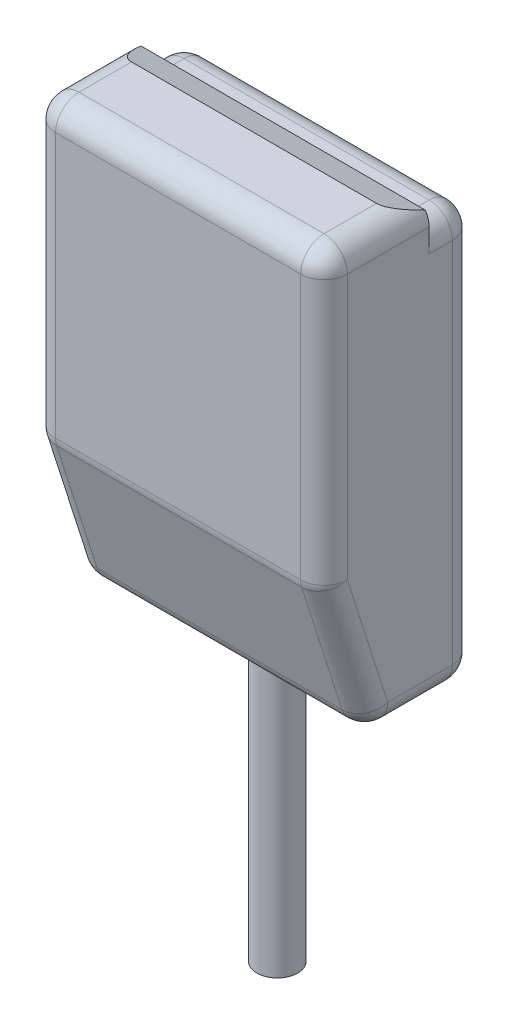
ISO-10303-21;
HEADER;
FILE_DESCRIPTION(('STEP AP214'),'2;1');
FILE_NAME('part.step','',(''),(''),'','','');
FILE_SCHEMA(('AUTOMOTIVE_DESIGN { 1 0 10303 214 1 1 1 1 }'));
ENDSEC;
DATA;
#1=APPLICATION_CONTEXT('core data for automotive mechanical design processes');
#2=APPLICATION_PROTOCOL_DEFINITION('international standard','automotive_design',2000,#1);
#3=PRODUCT_CONTEXT('',#1,'mechanical');
#4=PRODUCT('Part','Part','',(#3));
#5=PRODUCT_RELATED_PRODUCT_CATEGORY('part','',(#4));
#6=PRODUCT_DEFINITION_FORMATION('','',#4);
#7=PRODUCT_DEFINITION_CONTEXT('part definition',#1,'design');
#8=PRODUCT_DEFINITION('design','',#6,#7);
#9=PRODUCT_DEFINITION_SHAPE('','',#8);
#10=(LENGTH_UNIT() NAMED_UNIT(*) SI_UNIT(.MILLI.,.METRE.));
#11=(NAMED_UNIT(*) PLANE_ANGLE_UNIT() SI_UNIT($,.RADIAN.));
#12=(NAMED_UNIT(*) SI_UNIT($,.STERADIAN.) SOLID_ANGLE_UNIT());
#13=UNCERTAINTY_MEASURE_WITH_UNIT(LENGTH_MEASURE(1.E-05),#10,'distance_accuracy_value','');
#14=(GEOMETRIC_REPRESENTATION_CONTEXT(3) GLOBAL_UNCERTAINTY_ASSIGNED_CONTEXT((#13)) GLOBAL_UNIT_ASSIGNED_CONTEXT((#10,
#11,#12)) REPRESENTATION_CONTEXT('',''));
#15=CARTESIAN_POINT('',(0.,0.,0.));
#16=DIRECTION('',(0.,0.,1.));
#17=DIRECTION('',(1.,0.,0.));
#18=AXIS2_PLACEMENT_3D('',#15,#16,#17);
#19=CARTESIAN_POINT('',(50.,0.,4.00000000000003));
#20=DIRECTION('',(0.,1.,0.));
#21=DIRECTION('',(0.,0.,1.));
#22=AXIS2_PLACEMENT_3D('',#19,#20,#21);
#23=PLANE('',#22);
#24=DIRECTION('',(-1.,0.,0.));
#25=VECTOR('',#24,1.);
#26=CARTESIAN_POINT('',(50.,0.,15.0801904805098));
#27=LINE('',#26,#25);
#28=CARTESIAN_POINT('',(46.,0.,15.0801904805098));
#29=VERTEX_POINT('',#28);
#30=CARTESIAN_POINT('',(4.,0.,15.0801904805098));
#31=VERTEX_POINT('',#30);
#32=EDGE_CURVE('E366',#29,#31,#27,.T.);
#33=ORIENTED_EDGE('',*,*,#32,.T.);
#34=DIRECTION('',(0.,0.,-1.));
#35=VECTOR('',#34,1.);
#36=CARTESIAN_POINT('',(4.,0.,4.00000000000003));
#37=LINE('',#36,#35);
#38=CARTESIAN_POINT('',(4.,0.,4.00000000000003));
#39=VERTEX_POINT('',#38);
#40=EDGE_CURVE('E264',#31,#39,#37,.T.);
#41=ORIENTED_EDGE('',*,*,#40,.T.);
#42=DIRECTION('',(-1.,0.,0.));
#43=VECTOR('',#42,1.);
#44=CARTESIAN_POINT('',(50.,0.,4.00000000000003));
#45=LINE('',#44,#43);
#46=CARTESIAN_POINT('',(46.,0.,4.00000000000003));
#47=VERTEX_POINT('',#46);
#48=EDGE_CURVE('E363',#47,#39,#45,.T.);
#49=ORIENTED_EDGE('',*,*,#48,.F.);
#50=DIRECTION('',(0.,0.,-1.));
#51=VECTOR('',#50,1.);
#52=CARTESIAN_POINT('',(46.,0.,4.00000000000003));
#53=LINE('',#52,#51);
#54=EDGE_CURVE('E218',#47,#29,#53,.F.);
#55=ORIENTED_EDGE('',*,*,#54,.T.);
#56=EDGE_LOOP('',(#33,#41,#49,#55));
#57=FACE_BOUND('',#56,.T.);
#58=CARTESIAN_POINT('',(25.,0.,9.));
#59=DIRECTION('',(0.,1.,0.));
#60=DIRECTION('',(0.,0.,1.));
#61=AXIS2_PLACEMENT_3D('',#58,#59,#60);
#62=CIRCLE('',#61,3.5);
#63=CARTESIAN_POINT('',(25.,0.,12.5));
#64=VERTEX_POINT('',#63);
#65=EDGE_CURVE('E196',#64,#64,#62,.F.);
#66=ORIENTED_EDGE('',*,*,#65,.F.);
#67=EDGE_LOOP('',(#66));
#68=FACE_BOUND('',#67,.T.);
#69=ADVANCED_FACE('F31',(#57,#68),#23,.F.);
#70=CARTESIAN_POINT('',(50.,71.,8.));
#71=DIRECTION('',(0.,-1.,0.));
#72=DIRECTION('',(0.,0.,-1.));
#73=AXIS2_PLACEMENT_3D('',#70,#71,#72);
#74=PLANE('',#73);
#75=DIRECTION('',(-1.,0.,0.));
#76=VECTOR('',#75,1.);
#77=CARTESIAN_POINT('',(50.,71.,4.00000000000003));
#78=LINE('',#77,#76);
#79=CARTESIAN_POINT('',(46.,71.,4.00000000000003));
#80=VERTEX_POINT('',#79);
#81=CARTESIAN_POINT('',(4.,71.,4.00000000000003));
#82=VERTEX_POINT('',#81);
#83=EDGE_CURVE('E354',#80,#82,#78,.T.);
#84=ORIENTED_EDGE('',*,*,#83,.T.);
#85=DIRECTION('',(0.,0.,1.));
#86=VECTOR('',#85,1.);
#87=CARTESIAN_POINT('',(4.,71.,8.));
#88=LINE('',#87,#86);
#89=CARTESIAN_POINT('',(4.,71.,8.));
#90=VERTEX_POINT('',#89);
#91=EDGE_CURVE('E256',#82,#90,#88,.T.);
#92=ORIENTED_EDGE('',*,*,#91,.T.);
#93=DIRECTION('',(-1.,0.,0.));
#94=VECTOR('',#93,1.);
#95=CARTESIAN_POINT('',(50.,71.,8.));
#96=LINE('',#95,#94);
#97=CARTESIAN_POINT('',(46.,71.,8.));
#98=VERTEX_POINT('',#97);
#99=EDGE_CURVE('E201',#98,#90,#96,.T.);
#100=ORIENTED_EDGE('',*,*,#99,.F.);
#101=DIRECTION('',(0.,0.,1.));
#102=VECTOR('',#101,1.);
#103=CARTESIAN_POINT('',(46.,71.,8.));
#104=LINE('',#103,#102);
#105=EDGE_CURVE('E210',#98,#80,#104,.F.);
#106=ORIENTED_EDGE('',*,*,#105,.T.);
#107=EDGE_LOOP('',(#84,#92,#100,#106));
#108=FACE_BOUND('',#107,.T.);
#109=ADVANCED_FACE('F33',(#108),#74,.F.);
#110=CARTESIAN_POINT('',(50.,73.180148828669,8.));
#111=DIRECTION('',(0.,0.,1.));
#112=DIRECTION('',(1.,0.,0.));
#113=AXIS2_PLACEMENT_3D('',#110,#111,#112);
#114=PLANE('',#113);
#115=ORIENTED_EDGE('',*,*,#99,.T.);
#116=CARTESIAN_POINT('',(4.,67.,8.));
#117=DIRECTION('',(0.,0.,1.));
#118=DIRECTION('',(1.,0.,0.));
#119=AXIS2_PLACEMENT_3D('',#116,#117,#118);
#120=CIRCLE('',#119,4.);
#121=CARTESIAN_POINT('',(0.,67.,8.));
#122=VERTEX_POINT('',#121);
#123=EDGE_CURVE('E11',#90,#122,#120,.T.);
#124=ORIENTED_EDGE('',*,*,#123,.T.);
#125=DIRECTION('',(0.,1.,0.));
#126=VECTOR('',#125,1.);
#127=CARTESIAN_POINT('',(0.,73.180148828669,8.));
#128=LINE('',#127,#126);
#129=CARTESIAN_POINT('',(0.,71.,8.));
#130=VERTEX_POINT('',#129);
#131=EDGE_CURVE('E45',#130,#122,#128,.F.);
#132=ORIENTED_EDGE('',*,*,#131,.F.);
#133=CARTESIAN_POINT('',(4.,71.,8.));
#134=DIRECTION('',(0.,0.,1.));
#135=DIRECTION('',(1.,0.,0.));
#136=AXIS2_PLACEMENT_3D('',#133,#134,#135);
#137=CIRCLE('',#136,4.);
#138=CARTESIAN_POINT('',(0.646352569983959,73.180148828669,8.));
#139=VERTEX_POINT('',#138);
#140=EDGE_CURVE('E250',#130,#139,#137,.F.);
#141=ORIENTED_EDGE('',*,*,#140,.T.);
#142=DIRECTION('',(-1.,0.,0.));
#143=VECTOR('',#142,1.);
#144=CARTESIAN_POINT('',(50.,73.180148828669,8.));
#145=LINE('',#144,#143);
#146=CARTESIAN_POINT('',(49.353647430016,73.180148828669,8.));
#147=VERTEX_POINT('',#146);
#148=EDGE_CURVE('E175',#147,#139,#145,.T.);
#149=ORIENTED_EDGE('',*,*,#148,.F.);
#150=CARTESIAN_POINT('',(46.,71.,8.));
#151=DIRECTION('',(0.,0.,1.));
#152=DIRECTION('',(1.,0.,0.));
#153=AXIS2_PLACEMENT_3D('',#150,#151,#152);
#154=CIRCLE('',#153,4.);
#155=CARTESIAN_POINT('',(50.,71.,8.));
#156=VERTEX_POINT('',#155);
#157=EDGE_CURVE('E168',#147,#156,#154,.F.);
#158=ORIENTED_EDGE('',*,*,#157,.T.);
#159=DIRECTION('',(0.,1.,0.));
#160=VECTOR('',#159,1.);
#161=CARTESIAN_POINT('',(50.,73.180148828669,8.));
#162=LINE('',#161,#160);
#163=CARTESIAN_POINT('',(50.,67.,8.));
#164=VERTEX_POINT('',#163);
#165=EDGE_CURVE('E172',#164,#156,#162,.T.);
#166=ORIENTED_EDGE('',*,*,#165,.F.);
#167=CARTESIAN_POINT('',(46.,67.,8.));
#168=DIRECTION('',(0.,0.,1.));
#169=DIRECTION('',(1.,0.,0.));
#170=AXIS2_PLACEMENT_3D('',#167,#168,#169);
#171=CIRCLE('',#170,4.);
#172=EDGE_CURVE('E179',#164,#98,#171,.T.);
#173=ORIENTED_EDGE('',*,*,#172,.T.);
#174=EDGE_LOOP('',(#115,#124,#132,#141,#149,#158,#166,#173));
#175=FACE_BOUND('',#174,.T.);
#176=ADVANCED_FACE('F171',(#175),#114,.F.);
#177=CARTESIAN_POINT('',(50.,75.,13.));
#178=DIRECTION('',(0.,-0.939692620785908,0.342020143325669));
#179=DIRECTION('',(0.,-0.342020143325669,-0.939692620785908));
#180=AXIS2_PLACEMENT_3D('',#177,#178,#179);
#181=PLANE('',#180);
#182=ORIENTED_EDGE('',*,*,#148,.T.);
#183=CARTESIAN_POINT('',(4.,71.,2.01009032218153));
#184=DIRECTION('',(0.,-0.939692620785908,0.342020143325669));
#185=DIRECTION('',(0.,-0.342020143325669,-0.939692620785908));
#186=AXIS2_PLACEMENT_3D('',#183,#184,#185);
#187=ELLIPSE('',#186,11.6952176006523,4.);
#188=CARTESIAN_POINT('',(4.,75.,13.));
#189=VERTEX_POINT('',#188);
#190=EDGE_CURVE('E252',#139,#189,#187,.F.);
#191=ORIENTED_EDGE('',*,*,#190,.T.);
#192=DIRECTION('',(-1.,0.,0.));
#193=VECTOR('',#192,1.);
#194=CARTESIAN_POINT('',(50.,75.,13.));
#195=LINE('',#194,#193);
#196=CARTESIAN_POINT('',(46.,75.,13.));
#197=VERTEX_POINT('',#196);
#198=EDGE_CURVE('E376',#197,#189,#195,.T.);
#199=ORIENTED_EDGE('',*,*,#198,.F.);
#200=CARTESIAN_POINT('',(46.,71.,2.01009032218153));
#201=DIRECTION('',(0.,-0.939692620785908,0.342020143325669));
#202=DIRECTION('',(0.,0.342020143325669,0.939692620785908));
#203=AXIS2_PLACEMENT_3D('',#200,#201,#202);
#204=ELLIPSE('',#203,11.6952176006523,4.);
#205=EDGE_CURVE('E180',#197,#147,#204,.F.);
#206=ORIENTED_EDGE('',*,*,#205,.T.);
#207=EDGE_LOOP('',(#182,#191,#199,#206));
#208=FACE_BOUND('',#207,.T.);
#209=ADVANCED_FACE('F402',(#208),#181,.F.);
#210=CARTESIAN_POINT('',(50.,75.,22.));
#211=DIRECTION('',(0.,-1.,0.));
#212=DIRECTION('',(0.,0.,-1.));
#213=AXIS2_PLACEMENT_3D('',#210,#211,#212);
#214=PLANE('',#213);
#215=ORIENTED_EDGE('',*,*,#198,.T.);
#216=DIRECTION('',(0.,0.,1.));
#217=VECTOR('',#216,1.);
#218=CARTESIAN_POINT('',(4.,75.,22.));
#219=LINE('',#218,#217);
#220=CARTESIAN_POINT('',(4.,75.,22.));
#221=VERTEX_POINT('',#220);
#222=EDGE_CURVE('E234',#189,#221,#219,.T.);
#223=ORIENTED_EDGE('',*,*,#222,.T.);
#224=DIRECTION('',(-1.,0.,0.));
#225=VECTOR('',#224,1.);
#226=CARTESIAN_POINT('',(50.,75.,22.));
#227=LINE('',#226,#225);
#228=CARTESIAN_POINT('',(46.,75.,22.));
#229=VERTEX_POINT('',#228);
#230=EDGE_CURVE('E373',#229,#221,#227,.T.);
#231=ORIENTED_EDGE('',*,*,#230,.F.);
#232=DIRECTION('',(0.,0.,1.));
#233=VECTOR('',#232,1.);
#234=CARTESIAN_POINT('',(46.,75.,22.));
#235=LINE('',#234,#233);
#236=EDGE_CURVE('E230',#229,#197,#235,.F.);
#237=ORIENTED_EDGE('',*,*,#236,.T.);
#238=EDGE_LOOP('',(#215,#223,#231,#237));
#239=FACE_BOUND('',#238,.T.);
#240=ADVANCED_FACE('F502',(#239),#214,.F.);
#241=CARTESIAN_POINT('',(50.,71.,22.));
#242=DIRECTION('',(-1.,0.,0.));
#243=DIRECTION('',(0.,0.,1.));
#244=AXIS2_PLACEMENT_3D('',#241,#242,#243);
#245=CYLINDRICAL_SURFACE('',#244,4.);
#246=ORIENTED_EDGE('',*,*,#230,.T.);
#247=CARTESIAN_POINT('',(4.,71.,22.));
#248=DIRECTION('',(-1.,0.,0.));
#249=DIRECTION('',(0.,0.,1.));
#250=AXIS2_PLACEMENT_3D('',#247,#248,#249);
#251=CIRCLE('',#250,4.);
#252=CARTESIAN_POINT('',(4.,71.,26.));
#253=VERTEX_POINT('',#252);
#254=EDGE_CURVE('E254',#221,#253,#251,.F.);
#255=ORIENTED_EDGE('',*,*,#254,.T.);
#256=DIRECTION('',(-1.,0.,0.));
#257=VECTOR('',#256,1.);
#258=CARTESIAN_POINT('',(50.,71.,26.));
#259=LINE('',#258,#257);
#260=CARTESIAN_POINT('',(46.,71.,26.));
#261=VERTEX_POINT('',#260);
#262=EDGE_CURVE('E371',#261,#253,#259,.T.);
#263=ORIENTED_EDGE('',*,*,#262,.F.);
#264=CARTESIAN_POINT('',(46.,71.,22.));
#265=DIRECTION('',(-1.,0.,0.));
#266=DIRECTION('',(0.,0.,1.));
#267=AXIS2_PLACEMENT_3D('',#264,#265,#266);
#268=CIRCLE('',#267,4.);
#269=EDGE_CURVE('E228',#261,#229,#268,.T.);
#270=ORIENTED_EDGE('',*,*,#269,.T.);
#271=EDGE_LOOP('',(#246,#255,#263,#270));
#272=FACE_BOUND('',#271,.T.);
#273=ADVANCED_FACE('F499',(#272),#245,.T.);
#274=CARTESIAN_POINT('',(50.,25.6244047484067,26.));
#275=DIRECTION('',(0.,0.,-1.));
#276=DIRECTION('',(-1.,0.,0.));
#277=AXIS2_PLACEMENT_3D('',#274,#275,#276);
#278=PLANE('',#277);
#279=ORIENTED_EDGE('',*,*,#262,.T.);
#280=DIRECTION('',(0.,-1.,0.));
#281=VECTOR('',#280,1.);
#282=CARTESIAN_POINT('',(4.,25.6244047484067,26.));
#283=LINE('',#282,#281);
#284=CARTESIAN_POINT('',(4.,25.6244047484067,26.));
#285=VERTEX_POINT('',#284);
#286=EDGE_CURVE('E39',#253,#285,#283,.T.);
#287=ORIENTED_EDGE('',*,*,#286,.T.);
#288=DIRECTION('',(-1.,0.,0.));
#289=VECTOR('',#288,1.);
#290=CARTESIAN_POINT('',(50.,25.6244047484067,26.));
#291=LINE('',#290,#289);
#292=CARTESIAN_POINT('',(46.,25.6244047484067,26.));
#293=VERTEX_POINT('',#292);
#294=EDGE_CURVE('E278',#293,#285,#291,.T.);
#295=ORIENTED_EDGE('',*,*,#294,.F.);
#296=DIRECTION('',(0.,-1.,0.));
#297=VECTOR('',#296,1.);
#298=CARTESIAN_POINT('',(46.,25.6244047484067,26.));
#299=LINE('',#298,#297);
#300=EDGE_CURVE('E226',#293,#261,#299,.F.);
#301=ORIENTED_EDGE('',*,*,#300,.T.);
#302=EDGE_LOOP('',(#279,#287,#295,#301));
#303=FACE_BOUND('',#302,.T.);
#304=ADVANCED_FACE('F496',(#303),#278,.F.);
#305=CARTESIAN_POINT('',(50.,25.6244047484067,22.));
#306=DIRECTION('',(-1.,0.,0.));
#307=DIRECTION('',(0.,0.,1.));
#308=AXIS2_PLACEMENT_3D('',#305,#306,#307);
#309=CYLINDRICAL_SURFACE('',#308,4.);
#310=ORIENTED_EDGE('',*,*,#294,.T.);
#311=CARTESIAN_POINT('',(4.,25.6244047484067,22.));
#312=DIRECTION('',(-1.,0.,0.));
#313=DIRECTION('',(0.,0.,1.));
#314=AXIS2_PLACEMENT_3D('',#311,#312,#313);
#315=CIRCLE('',#314,4.);
#316=CARTESIAN_POINT('',(4.,24.4053018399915,25.8096965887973));
#317=VERTEX_POINT('',#316);
#318=EDGE_CURVE('E270',#285,#317,#315,.F.);
#319=ORIENTED_EDGE('',*,*,#318,.T.);
#320=DIRECTION('',(-1.,0.,0.));
#321=VECTOR('',#320,1.);
#322=CARTESIAN_POINT('',(50.,24.4053018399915,25.8096965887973));
#323=LINE('',#322,#321);
#324=CARTESIAN_POINT('',(46.,24.4053018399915,25.8096965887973));
#325=VERTEX_POINT('',#324);
#326=EDGE_CURVE('E276',#325,#317,#323,.T.);
#327=ORIENTED_EDGE('',*,*,#326,.F.);
#328=CARTESIAN_POINT('',(46.,25.6244047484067,22.));
#329=DIRECTION('',(-1.,0.,0.));
#330=DIRECTION('',(0.,0.,1.));
#331=AXIS2_PLACEMENT_3D('',#328,#329,#330);
#332=CIRCLE('',#331,4.);
#333=EDGE_CURVE('E224',#325,#293,#332,.T.);
#334=ORIENTED_EDGE('',*,*,#333,.T.);
#335=EDGE_LOOP('',(#310,#319,#327,#334));
#336=FACE_BOUND('',#335,.T.);
#337=ADVANCED_FACE('F275',(#336),#309,.T.);
#338=CARTESIAN_POINT('',(50.,2.78089709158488,18.8898870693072));
#339=DIRECTION('',(0.,0.304775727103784,-0.952424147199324));
#340=DIRECTION('',(0.,0.952424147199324,0.304775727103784));
#341=AXIS2_PLACEMENT_3D('',#338,#339,#340);
#342=PLANE('',#341);
#343=ORIENTED_EDGE('',*,*,#326,.T.);
#344=DIRECTION('',(0.,-0.952424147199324,-0.304775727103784));
#345=VECTOR('',#344,1.);
#346=CARTESIAN_POINT('',(4.,2.78089709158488,18.8898870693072));
#347=LINE('',#346,#345);
#348=CARTESIAN_POINT('',(4.,2.78089709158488,18.8898870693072));
#349=VERTEX_POINT('',#348);
#350=EDGE_CURVE('E268',#317,#349,#347,.T.);
#351=ORIENTED_EDGE('',*,*,#350,.T.);
#352=DIRECTION('',(-1.,0.,0.));
#353=VECTOR('',#352,1.);
#354=CARTESIAN_POINT('',(50.,2.78089709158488,18.8898870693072));
#355=LINE('',#354,#353);
#356=CARTESIAN_POINT('',(46.,2.78089709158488,18.8898870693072));
#357=VERTEX_POINT('',#356);
#358=EDGE_CURVE('E289',#357,#349,#355,.T.);
#359=ORIENTED_EDGE('',*,*,#358,.F.);
#360=DIRECTION('',(0.,-0.952424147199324,-0.304775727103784));
#361=VECTOR('',#360,1.);
#362=CARTESIAN_POINT('',(46.,2.78089709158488,18.8898870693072));
#363=LINE('',#362,#361);
#364=EDGE_CURVE('E222',#357,#325,#363,.F.);
#365=ORIENTED_EDGE('',*,*,#364,.T.);
#366=EDGE_LOOP('',(#343,#351,#359,#365));
#367=FACE_BOUND('',#366,.T.);
#368=ADVANCED_FACE('F285',(#367),#342,.F.);
#369=CARTESIAN_POINT('',(50.,4.,15.0801904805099));
#370=DIRECTION('',(-1.,0.,0.));
#371=DIRECTION('',(0.,0.,1.));
#372=AXIS2_PLACEMENT_3D('',#369,#370,#371);
#373=CYLINDRICAL_SURFACE('',#372,4.);
#374=ORIENTED_EDGE('',*,*,#358,.T.);
#375=CARTESIAN_POINT('',(4.,4.,15.0801904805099));
#376=DIRECTION('',(-1.,0.,0.));
#377=DIRECTION('',(0.,0.,1.));
#378=AXIS2_PLACEMENT_3D('',#375,#376,#377);
#379=CIRCLE('',#378,4.);
#380=EDGE_CURVE('E266',#349,#31,#379,.F.);
#381=ORIENTED_EDGE('',*,*,#380,.T.);
#382=ORIENTED_EDGE('',*,*,#32,.F.);
#383=CARTESIAN_POINT('',(46.,4.,15.0801904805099));
#384=DIRECTION('',(-1.,0.,0.));
#385=DIRECTION('',(0.,0.,1.));
#386=AXIS2_PLACEMENT_3D('',#383,#384,#385);
#387=CIRCLE('',#386,4.);
#388=EDGE_CURVE('E220',#29,#357,#387,.T.);
#389=ORIENTED_EDGE('',*,*,#388,.T.);
#390=EDGE_LOOP('',(#374,#381,#382,#389));
#391=FACE_BOUND('',#390,.T.);
#392=ADVANCED_FACE('F467',(#391),#373,.T.);
#393=CARTESIAN_POINT('',(50.,4.,4.));
#394=DIRECTION('',(-1.,0.,0.));
#395=DIRECTION('',(0.,0.,1.));
#396=AXIS2_PLACEMENT_3D('',#393,#394,#395);
#397=CYLINDRICAL_SURFACE('',#396,4.);
#398=ORIENTED_EDGE('',*,*,#48,.T.);
#399=CARTESIAN_POINT('',(4.,4.,4.));
#400=DIRECTION('',(-1.,0.,0.));
#401=DIRECTION('',(0.,0.,1.));
#402=AXIS2_PLACEMENT_3D('',#399,#400,#401);
#403=CIRCLE('',#402,4.);
#404=CARTESIAN_POINT('',(4.,4.00000000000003,0.));
#405=VERTEX_POINT('',#404);
#406=EDGE_CURVE('E262',#39,#405,#403,.F.);
#407=ORIENTED_EDGE('',*,*,#406,.T.);
#408=DIRECTION('',(-1.,0.,0.));
#409=VECTOR('',#408,1.);
#410=CARTESIAN_POINT('',(50.,4.00000000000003,0.));
#411=LINE('',#410,#409);
#412=CARTESIAN_POINT('',(46.,4.00000000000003,0.));
#413=VERTEX_POINT('',#412);
#414=EDGE_CURVE('E360',#413,#405,#411,.T.);
#415=ORIENTED_EDGE('',*,*,#414,.F.);
#416=CARTESIAN_POINT('',(46.,4.,4.));
#417=DIRECTION('',(-1.,0.,0.));
#418=DIRECTION('',(0.,0.,1.));
#419=AXIS2_PLACEMENT_3D('',#416,#417,#418);
#420=CIRCLE('',#419,4.);
#421=EDGE_CURVE('E216',#413,#47,#420,.T.);
#422=ORIENTED_EDGE('',*,*,#421,.T.);
#423=EDGE_LOOP('',(#398,#407,#415,#422));
#424=FACE_BOUND('',#423,.T.);
#425=ADVANCED_FACE('F472',(#424),#397,.T.);
#426=CARTESIAN_POINT('',(50.,4.00000000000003,0.));
#427=DIRECTION('',(0.,0.,1.));
#428=DIRECTION('',(1.,0.,0.));
#429=AXIS2_PLACEMENT_3D('',#426,#427,#428);
#430=PLANE('',#429);
#431=ORIENTED_EDGE('',*,*,#414,.T.);
#432=DIRECTION('',(0.,1.,0.));
#433=VECTOR('',#432,1.);
#434=CARTESIAN_POINT('',(4.,67.,0.));
#435=LINE('',#434,#433);
#436=CARTESIAN_POINT('',(4.,67.,0.));
#437=VERTEX_POINT('',#436);
#438=EDGE_CURVE('E260',#405,#437,#435,.T.);
#439=ORIENTED_EDGE('',*,*,#438,.T.);
#440=DIRECTION('',(-1.,0.,0.));
#441=VECTOR('',#440,1.);
#442=CARTESIAN_POINT('',(50.,67.,0.));
#443=LINE('',#442,#441);
#444=CARTESIAN_POINT('',(46.,67.,0.));
#445=VERTEX_POINT('',#444);
#446=EDGE_CURVE('E357',#445,#437,#443,.T.);
#447=ORIENTED_EDGE('',*,*,#446,.F.);
#448=DIRECTION('',(0.,1.,0.));
#449=VECTOR('',#448,1.);
#450=CARTESIAN_POINT('',(46.,4.00000000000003,0.));
#451=LINE('',#450,#449);
#452=EDGE_CURVE('E214',#445,#413,#451,.F.);
#453=ORIENTED_EDGE('',*,*,#452,.T.);
#454=EDGE_LOOP('',(#431,#439,#447,#453));
#455=FACE_BOUND('',#454,.T.);
#456=ADVANCED_FACE('F475',(#455),#430,.F.);
#457=CARTESIAN_POINT('',(50.,67.,4.));
#458=DIRECTION('',(-1.,0.,0.));
#459=DIRECTION('',(0.,0.,1.));
#460=AXIS2_PLACEMENT_3D('',#457,#458,#459);
#461=CYLINDRICAL_SURFACE('',#460,4.);
#462=ORIENTED_EDGE('',*,*,#446,.T.);
#463=CARTESIAN_POINT('',(4.,67.,4.));
#464=DIRECTION('',(-1.,0.,0.));
#465=DIRECTION('',(0.,0.,1.));
#466=AXIS2_PLACEMENT_3D('',#463,#464,#465);
#467=CIRCLE('',#466,4.);
#468=EDGE_CURVE('E258',#437,#82,#467,.F.);
#469=ORIENTED_EDGE('',*,*,#468,.T.);
#470=ORIENTED_EDGE('',*,*,#83,.F.);
#471=CARTESIAN_POINT('',(46.,67.,4.));
#472=DIRECTION('',(-1.,0.,0.));
#473=DIRECTION('',(0.,0.,1.));
#474=AXIS2_PLACEMENT_3D('',#471,#472,#473);
#475=CIRCLE('',#474,4.);
#476=EDGE_CURVE('E212',#80,#445,#475,.T.);
#477=ORIENTED_EDGE('',*,*,#476,.T.);
#478=EDGE_LOOP('',(#462,#469,#470,#477));
#479=FACE_BOUND('',#478,.T.);
#480=ADVANCED_FACE('F445',(#479),#461,.T.);
#481=CARTESIAN_POINT('',(50.,67.,4.));
#482=DIRECTION('',(-1.,0.,0.));
#483=DIRECTION('',(0.,0.,1.));
#484=AXIS2_PLACEMENT_3D('',#481,#482,#483);
#485=PLANE('',#484);
#486=DIRECTION('',(0.,1.,0.));
#487=VECTOR('',#486,1.);
#488=CARTESIAN_POINT('',(50.,67.,4.));
#489=LINE('',#488,#487);
#490=CARTESIAN_POINT('',(50.,4.,4.));
#491=VERTEX_POINT('',#490);
#492=CARTESIAN_POINT('',(50.,67.,4.));
#493=VERTEX_POINT('',#492);
#494=EDGE_CURVE('E188',#491,#493,#489,.T.);
#495=ORIENTED_EDGE('',*,*,#494,.T.);
#496=DIRECTION('',(0.,0.,1.));
#497=VECTOR('',#496,1.);
#498=CARTESIAN_POINT('',(50.,67.,4.));
#499=LINE('',#498,#497);
#500=EDGE_CURVE('E187',#493,#164,#499,.T.);
#501=ORIENTED_EDGE('',*,*,#500,.T.);
#502=ORIENTED_EDGE('',*,*,#165,.T.);
#503=DIRECTION('',(0.,0.,1.));
#504=VECTOR('',#503,1.);
#505=CARTESIAN_POINT('',(50.,71.,4.));
#506=LINE('',#505,#504);
#507=CARTESIAN_POINT('',(50.,71.,22.));
#508=VERTEX_POINT('',#507);
#509=EDGE_CURVE('E184',#156,#508,#506,.T.);
#510=ORIENTED_EDGE('',*,*,#509,.T.);
#511=DIRECTION('',(0.,-1.,0.));
#512=VECTOR('',#511,1.);
#513=CARTESIAN_POINT('',(50.,67.,22.));
#514=LINE('',#513,#512);
#515=CARTESIAN_POINT('',(50.,25.6244047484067,22.));
#516=VERTEX_POINT('',#515);
#517=EDGE_CURVE('E195',#508,#516,#514,.T.);
#518=ORIENTED_EDGE('',*,*,#517,.T.);
#519=DIRECTION('',(0.,-0.952424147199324,-0.304775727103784));
#520=VECTOR('',#519,1.);
#521=CARTESIAN_POINT('',(50.,57.931729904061,32.3383440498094));
#522=LINE('',#521,#520);
#523=CARTESIAN_POINT('',(50.,4.,15.0801904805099));
#524=VERTEX_POINT('',#523);
#525=EDGE_CURVE('E198',#516,#524,#522,.T.);
#526=ORIENTED_EDGE('',*,*,#525,.T.);
#527=DIRECTION('',(0.,0.,-1.));
#528=VECTOR('',#527,1.);
#529=CARTESIAN_POINT('',(50.,4.,3.99999999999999));
#530=LINE('',#529,#528);
#531=EDGE_CURVE('E206',#524,#491,#530,.T.);
#532=ORIENTED_EDGE('',*,*,#531,.T.);
#533=EDGE_LOOP('',(#495,#501,#502,#510,#518,#526,#532));
#534=FACE_BOUND('',#533,.T.);
#535=ADVANCED_FACE('F183',(#534),#485,.F.);
#536=CARTESIAN_POINT('',(0.,67.,4.));
#537=DIRECTION('',(-1.,0.,0.));
#538=DIRECTION('',(0.,0.,1.));
#539=AXIS2_PLACEMENT_3D('',#536,#537,#538);
#540=PLANE('',#539);
#541=DIRECTION('',(0.,-1.,0.));
#542=VECTOR('',#541,1.);
#543=CARTESIAN_POINT('',(0.,71.,22.));
#544=LINE('',#543,#542);
#545=CARTESIAN_POINT('',(0.,25.6244047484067,22.));
#546=VERTEX_POINT('',#545);
#547=CARTESIAN_POINT('',(0.,71.,22.));
#548=VERTEX_POINT('',#547);
#549=EDGE_CURVE('E237',#546,#548,#544,.F.);
#550=ORIENTED_EDGE('',*,*,#549,.T.);
#551=DIRECTION('',(0.,0.,1.));
#552=VECTOR('',#551,1.);
#553=CARTESIAN_POINT('',(0.,71.,13.));
#554=LINE('',#553,#552);
#555=EDGE_CURVE('E248',#548,#130,#554,.F.);
#556=ORIENTED_EDGE('',*,*,#555,.T.);
#557=ORIENTED_EDGE('',*,*,#131,.T.);
#558=DIRECTION('',(0.,0.,1.));
#559=VECTOR('',#558,1.);
#560=CARTESIAN_POINT('',(0.,67.,4.00000000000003));
#561=LINE('',#560,#559);
#562=CARTESIAN_POINT('',(0.,67.,4.));
#563=VERTEX_POINT('',#562);
#564=EDGE_CURVE('E245',#122,#563,#561,.F.);
#565=ORIENTED_EDGE('',*,*,#564,.T.);
#566=DIRECTION('',(0.,1.,0.));
#567=VECTOR('',#566,1.);
#568=CARTESIAN_POINT('',(0.,4.00000000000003,4.));
#569=LINE('',#568,#567);
#570=CARTESIAN_POINT('',(0.,4.,4.));
#571=VERTEX_POINT('',#570);
#572=EDGE_CURVE('E243',#563,#571,#569,.F.);
#573=ORIENTED_EDGE('',*,*,#572,.T.);
#574=DIRECTION('',(0.,0.,-1.));
#575=VECTOR('',#574,1.);
#576=CARTESIAN_POINT('',(0.,4.,15.0801904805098));
#577=LINE('',#576,#575);
#578=CARTESIAN_POINT('',(0.,4.,15.0801904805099));
#579=VERTEX_POINT('',#578);
#580=EDGE_CURVE('E241',#571,#579,#577,.F.);
#581=ORIENTED_EDGE('',*,*,#580,.T.);
#582=DIRECTION('',(0.,-0.952424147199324,-0.304775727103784));
#583=VECTOR('',#582,1.);
#584=CARTESIAN_POINT('',(0.,25.6244047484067,22.));
#585=LINE('',#584,#583);
#586=EDGE_CURVE('E239',#579,#546,#585,.F.);
#587=ORIENTED_EDGE('',*,*,#586,.T.);
#588=EDGE_LOOP('',(#550,#556,#557,#565,#573,#581,#587));
#589=FACE_BOUND('',#588,.T.);
#590=ADVANCED_FACE('F390',(#589),#540,.T.);
#591=CARTESIAN_POINT('',(25.,-50.,8.99999999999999));
#592=DIRECTION('',(0.,1.,0.));
#593=DIRECTION('',(0.,0.,1.));
#594=AXIS2_PLACEMENT_3D('',#591,#592,#593);
#595=CYLINDRICAL_SURFACE('',#594,3.5);
#596=CARTESIAN_POINT('',(25.,-50.,8.99999999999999));
#597=DIRECTION('',(0.,-1.,0.));
#598=DIRECTION('',(0.,0.,-1.));
#599=AXIS2_PLACEMENT_3D('',#596,#597,#598);
#600=CIRCLE('',#599,3.5);
#601=CARTESIAN_POINT('',(25.,-50.,5.49999999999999));
#602=VERTEX_POINT('',#601);
#603=EDGE_CURVE('E351',#602,#602,#600,.T.);
#604=ORIENTED_EDGE('',*,*,#603,.F.);
#605=EDGE_LOOP('',(#604));
#606=FACE_BOUND('',#605,.T.);
#607=ORIENTED_EDGE('',*,*,#65,.T.);
#608=EDGE_LOOP('',(#607));
#609=FACE_BOUND('',#608,.T.);
#610=ADVANCED_FACE('F565',(#606,#609),#595,.T.);
#611=CARTESIAN_POINT('',(25.,-50.,8.99999999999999));
#612=DIRECTION('',(0.,-1.,0.));
#613=DIRECTION('',(0.,0.,-1.));
#614=AXIS2_PLACEMENT_3D('',#611,#612,#613);
#615=PLANE('',#614);
#616=ORIENTED_EDGE('',*,*,#603,.T.);
#617=EDGE_LOOP('',(#616));
#618=FACE_BOUND('',#617,.T.);
#619=ADVANCED_FACE('F689',(#618),#615,.T.);
#620=CARTESIAN_POINT('',(46.,71.,4.));
#621=DIRECTION('',(0.,0.,1.));
#622=DIRECTION('',(1.,0.,0.));
#623=AXIS2_PLACEMENT_3D('',#620,#621,#622);
#624=CYLINDRICAL_SURFACE('',#623,4.);
#625=ORIENTED_EDGE('',*,*,#205,.F.);
#626=ORIENTED_EDGE('',*,*,#236,.F.);
#627=CARTESIAN_POINT('',(46.,71.,22.));
#628=DIRECTION('',(0.,0.,1.));
#629=DIRECTION('',(0.,-1.,0.));
#630=AXIS2_PLACEMENT_3D('',#627,#628,#629);
#631=CIRCLE('',#630,4.);
#632=EDGE_CURVE('E193',#508,#229,#631,.T.);
#633=ORIENTED_EDGE('',*,*,#632,.F.);
#634=ORIENTED_EDGE('',*,*,#509,.F.);
#635=ORIENTED_EDGE('',*,*,#157,.F.);
#636=EDGE_LOOP('',(#625,#626,#633,#634,#635));
#637=FACE_BOUND('',#636,.T.);
#638=ADVANCED_FACE('F190',(#637),#624,.T.);
#639=CARTESIAN_POINT('',(46.,71.,22.));
#640=DIRECTION('',(0.,0.,1.));
#641=DIRECTION('',(1.,0.,0.));
#642=AXIS2_PLACEMENT_3D('',#639,#640,#641);
#643=SPHERICAL_SURFACE('',#642,4.);
#644=ORIENTED_EDGE('',*,*,#632,.T.);
#645=ORIENTED_EDGE('',*,*,#269,.F.);
#646=CARTESIAN_POINT('',(46.,71.,22.));
#647=DIRECTION('',(0.,-1.,0.));
#648=DIRECTION('',(0.,0.,-1.));
#649=AXIS2_PLACEMENT_3D('',#646,#647,#648);
#650=CIRCLE('',#649,4.);
#651=EDGE_CURVE('E347',#508,#261,#650,.T.);
#652=ORIENTED_EDGE('',*,*,#651,.F.);
#653=EDGE_LOOP('',(#644,#645,#652));
#654=FACE_BOUND('',#653,.T.);
#655=ADVANCED_FACE('F408',(#654),#643,.T.);
#656=CARTESIAN_POINT('',(46.,67.,22.));
#657=DIRECTION('',(0.,-1.,0.));
#658=DIRECTION('',(0.,0.,-1.));
#659=AXIS2_PLACEMENT_3D('',#656,#657,#658);
#660=CYLINDRICAL_SURFACE('',#659,4.);
#661=ORIENTED_EDGE('',*,*,#651,.T.);
#662=ORIENTED_EDGE('',*,*,#300,.F.);
#663=CARTESIAN_POINT('',(46.,25.6244047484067,22.));
#664=DIRECTION('',(0.,-1.,0.));
#665=DIRECTION('',(0.,0.,-1.));
#666=AXIS2_PLACEMENT_3D('',#663,#664,#665);
#667=CIRCLE('',#666,4.);
#668=EDGE_CURVE('E344',#516,#293,#667,.T.);
#669=ORIENTED_EDGE('',*,*,#668,.F.);
#670=ORIENTED_EDGE('',*,*,#517,.F.);
#671=EDGE_LOOP('',(#661,#662,#669,#670));
#672=FACE_BOUND('',#671,.T.);
#673=ADVANCED_FACE('F413',(#672),#660,.T.);
#674=CARTESIAN_POINT('',(46.,25.6244047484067,22.));
#675=DIRECTION('',(0.,0.,1.));
#676=DIRECTION('',(1.,0.,0.));
#677=AXIS2_PLACEMENT_3D('',#674,#675,#676);
#678=SPHERICAL_SURFACE('',#677,4.);
#679=ORIENTED_EDGE('',*,*,#668,.T.);
#680=ORIENTED_EDGE('',*,*,#333,.F.);
#681=CARTESIAN_POINT('',(46.,25.6244047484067,22.));
#682=DIRECTION('',(0.,-0.952424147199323,-0.304775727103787));
#683=DIRECTION('',(0.,0.304775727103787,-0.952424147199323));
#684=AXIS2_PLACEMENT_3D('',#681,#682,#683);
#685=CIRCLE('',#684,4.);
#686=EDGE_CURVE('E341',#516,#325,#685,.T.);
#687=ORIENTED_EDGE('',*,*,#686,.F.);
#688=EDGE_LOOP('',(#679,#680,#687));
#689=FACE_BOUND('',#688,.T.);
#690=ADVANCED_FACE('F679',(#689),#678,.T.);
#691=CARTESIAN_POINT('',(46.,57.931729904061,32.3383440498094));
#692=DIRECTION('',(0.,-0.952424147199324,-0.304775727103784));
#693=DIRECTION('',(0.,0.304775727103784,-0.952424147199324));
#694=AXIS2_PLACEMENT_3D('',#691,#692,#693);
#695=CYLINDRICAL_SURFACE('',#694,4.);
#696=ORIENTED_EDGE('',*,*,#686,.T.);
#697=ORIENTED_EDGE('',*,*,#364,.F.);
#698=CARTESIAN_POINT('',(46.,4.,15.0801904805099));
#699=DIRECTION('',(0.,-0.952424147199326,-0.304775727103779));
#700=DIRECTION('',(0.,0.304775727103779,-0.952424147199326));
#701=AXIS2_PLACEMENT_3D('',#698,#699,#700);
#702=CIRCLE('',#701,4.);
#703=EDGE_CURVE('E338',#524,#357,#702,.T.);
#704=ORIENTED_EDGE('',*,*,#703,.F.);
#705=ORIENTED_EDGE('',*,*,#525,.F.);
#706=EDGE_LOOP('',(#696,#697,#704,#705));
#707=FACE_BOUND('',#706,.T.);
#708=ADVANCED_FACE('F421',(#707),#695,.T.);
#709=CARTESIAN_POINT('',(46.,4.,15.0801904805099));
#710=DIRECTION('',(0.,0.,1.));
#711=DIRECTION('',(1.,0.,0.));
#712=AXIS2_PLACEMENT_3D('',#709,#710,#711);
#713=SPHERICAL_SURFACE('',#712,4.);
#714=ORIENTED_EDGE('',*,*,#703,.T.);
#715=ORIENTED_EDGE('',*,*,#388,.F.);
#716=CARTESIAN_POINT('',(46.,4.,15.0801904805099));
#717=DIRECTION('',(0.,0.,-1.));
#718=DIRECTION('',(0.,1.,0.));
#719=AXIS2_PLACEMENT_3D('',#716,#717,#718);
#720=CIRCLE('',#719,4.);
#721=EDGE_CURVE('E335',#524,#29,#720,.T.);
#722=ORIENTED_EDGE('',*,*,#721,.F.);
#723=EDGE_LOOP('',(#714,#715,#722));
#724=FACE_BOUND('',#723,.T.);
#725=ADVANCED_FACE('F424',(#724),#713,.T.);
#726=CARTESIAN_POINT('',(46.,4.,3.99999999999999));
#727=DIRECTION('',(0.,0.,-1.));
#728=DIRECTION('',(0.,1.,0.));
#729=AXIS2_PLACEMENT_3D('',#726,#727,#728);
#730=CYLINDRICAL_SURFACE('',#729,4.);
#731=ORIENTED_EDGE('',*,*,#721,.T.);
#732=ORIENTED_EDGE('',*,*,#54,.F.);
#733=CARTESIAN_POINT('',(46.,4.,4.));
#734=DIRECTION('',(0.,0.,-1.));
#735=DIRECTION('',(0.,1.,0.));
#736=AXIS2_PLACEMENT_3D('',#733,#734,#735);
#737=CIRCLE('',#736,4.);
#738=EDGE_CURVE('E332',#491,#47,#737,.T.);
#739=ORIENTED_EDGE('',*,*,#738,.F.);
#740=ORIENTED_EDGE('',*,*,#531,.F.);
#741=EDGE_LOOP('',(#731,#732,#739,#740));
#742=FACE_BOUND('',#741,.T.);
#743=ADVANCED_FACE('F427',(#742),#730,.T.);
#744=CARTESIAN_POINT('',(46.,4.,4.));
#745=DIRECTION('',(0.,0.,1.));
#746=DIRECTION('',(1.,0.,0.));
#747=AXIS2_PLACEMENT_3D('',#744,#745,#746);
#748=SPHERICAL_SURFACE('',#747,4.);
#749=ORIENTED_EDGE('',*,*,#738,.T.);
#750=ORIENTED_EDGE('',*,*,#421,.F.);
#751=CARTESIAN_POINT('',(46.,4.,4.));
#752=DIRECTION('',(0.,1.,0.));
#753=DIRECTION('',(0.,0.,1.));
#754=AXIS2_PLACEMENT_3D('',#751,#752,#753);
#755=CIRCLE('',#754,4.);
#756=EDGE_CURVE('E329',#491,#413,#755,.T.);
#757=ORIENTED_EDGE('',*,*,#756,.F.);
#758=EDGE_LOOP('',(#749,#750,#757));
#759=FACE_BOUND('',#758,.T.);
#760=ADVANCED_FACE('F432',(#759),#748,.T.);
#761=CARTESIAN_POINT('',(46.,67.,4.));
#762=DIRECTION('',(0.,1.,0.));
#763=DIRECTION('',(0.,0.,1.));
#764=AXIS2_PLACEMENT_3D('',#761,#762,#763);
#765=CYLINDRICAL_SURFACE('',#764,4.);
#766=ORIENTED_EDGE('',*,*,#756,.T.);
#767=ORIENTED_EDGE('',*,*,#452,.F.);
#768=CARTESIAN_POINT('',(46.,67.,4.));
#769=DIRECTION('',(0.,1.,0.));
#770=DIRECTION('',(0.,0.,1.));
#771=AXIS2_PLACEMENT_3D('',#768,#769,#770);
#772=CIRCLE('',#771,4.);
#773=EDGE_CURVE('E326',#493,#445,#772,.T.);
#774=ORIENTED_EDGE('',*,*,#773,.F.);
#775=ORIENTED_EDGE('',*,*,#494,.F.);
#776=EDGE_LOOP('',(#766,#767,#774,#775));
#777=FACE_BOUND('',#776,.T.);
#778=ADVANCED_FACE('F436',(#777),#765,.T.);
#779=CARTESIAN_POINT('',(46.,67.,4.));
#780=DIRECTION('',(0.,0.,1.));
#781=DIRECTION('',(1.,0.,0.));
#782=AXIS2_PLACEMENT_3D('',#779,#780,#781);
#783=SPHERICAL_SURFACE('',#782,4.);
#784=ORIENTED_EDGE('',*,*,#773,.T.);
#785=ORIENTED_EDGE('',*,*,#476,.F.);
#786=CARTESIAN_POINT('',(46.,67.,4.));
#787=DIRECTION('',(0.,0.,1.));
#788=DIRECTION('',(0.,-1.,0.));
#789=AXIS2_PLACEMENT_3D('',#786,#787,#788);
#790=CIRCLE('',#789,4.);
#791=EDGE_CURVE('E323',#493,#80,#790,.T.);
#792=ORIENTED_EDGE('',*,*,#791,.F.);
#793=EDGE_LOOP('',(#784,#785,#792));
#794=FACE_BOUND('',#793,.T.);
#795=ADVANCED_FACE('F440',(#794),#783,.T.);
#796=CARTESIAN_POINT('',(46.,67.,4.));
#797=DIRECTION('',(0.,0.,1.));
#798=DIRECTION('',(1.,0.,0.));
#799=AXIS2_PLACEMENT_3D('',#796,#797,#798);
#800=CYLINDRICAL_SURFACE('',#799,4.);
#801=ORIENTED_EDGE('',*,*,#791,.T.);
#802=ORIENTED_EDGE('',*,*,#105,.F.);
#803=ORIENTED_EDGE('',*,*,#172,.F.);
#804=ORIENTED_EDGE('',*,*,#500,.F.);
#805=EDGE_LOOP('',(#801,#802,#803,#804));
#806=FACE_BOUND('',#805,.T.);
#807=ADVANCED_FACE('F442',(#806),#800,.T.);
#808=CARTESIAN_POINT('',(4.,67.,8.));
#809=DIRECTION('',(0.,0.,-1.));
#810=DIRECTION('',(-1.,0.,0.));
#811=AXIS2_PLACEMENT_3D('',#808,#809,#810);
#812=CYLINDRICAL_SURFACE('',#811,4.);
#813=ORIENTED_EDGE('',*,*,#123,.F.);
#814=ORIENTED_EDGE('',*,*,#91,.F.);
#815=CARTESIAN_POINT('',(4.,67.,4.00000000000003));
#816=DIRECTION('',(0.,0.,-1.));
#817=DIRECTION('',(-1.,0.,0.));
#818=AXIS2_PLACEMENT_3D('',#815,#816,#817);
#819=CIRCLE('',#818,4.);
#820=EDGE_CURVE('E320',#563,#82,#819,.T.);
#821=ORIENTED_EDGE('',*,*,#820,.F.);
#822=ORIENTED_EDGE('',*,*,#564,.F.);
#823=EDGE_LOOP('',(#813,#814,#821,#822));
#824=FACE_BOUND('',#823,.T.);
#825=ADVANCED_FACE('F386',(#824),#812,.T.);
#826=CARTESIAN_POINT('',(4.,67.,4.));
#827=DIRECTION('',(0.,0.,1.));
#828=DIRECTION('',(1.,0.,0.));
#829=AXIS2_PLACEMENT_3D('',#826,#827,#828);
#830=SPHERICAL_SURFACE('',#829,4.);
#831=ORIENTED_EDGE('',*,*,#820,.T.);
#832=ORIENTED_EDGE('',*,*,#468,.F.);
#833=CARTESIAN_POINT('',(4.,67.,4.));
#834=DIRECTION('',(0.,-1.,0.));
#835=DIRECTION('',(0.,0.,-1.));
#836=AXIS2_PLACEMENT_3D('',#833,#834,#835);
#837=CIRCLE('',#836,4.);
#838=EDGE_CURVE('E317',#563,#437,#837,.T.);
#839=ORIENTED_EDGE('',*,*,#838,.F.);
#840=EDGE_LOOP('',(#831,#832,#839));
#841=FACE_BOUND('',#840,.T.);
#842=ADVANCED_FACE('F449',(#841),#830,.T.);
#843=CARTESIAN_POINT('',(4.,4.00000000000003,4.));
#844=DIRECTION('',(0.,-1.,0.));
#845=DIRECTION('',(0.,0.,-1.));
#846=AXIS2_PLACEMENT_3D('',#843,#844,#845);
#847=CYLINDRICAL_SURFACE('',#846,4.);
#848=ORIENTED_EDGE('',*,*,#838,.T.);
#849=ORIENTED_EDGE('',*,*,#438,.F.);
#850=CARTESIAN_POINT('',(4.,4.00000000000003,4.));
#851=DIRECTION('',(0.,-1.,0.));
#852=DIRECTION('',(0.,0.,-1.));
#853=AXIS2_PLACEMENT_3D('',#850,#851,#852);
#854=CIRCLE('',#853,4.);
#855=EDGE_CURVE('E314',#571,#405,#854,.T.);
#856=ORIENTED_EDGE('',*,*,#855,.F.);
#857=ORIENTED_EDGE('',*,*,#572,.F.);
#858=EDGE_LOOP('',(#848,#849,#856,#857));
#859=FACE_BOUND('',#858,.T.);
#860=ADVANCED_FACE('F452',(#859),#847,.T.);
#861=CARTESIAN_POINT('',(4.,4.,4.));
#862=DIRECTION('',(0.,0.,1.));
#863=DIRECTION('',(1.,0.,0.));
#864=AXIS2_PLACEMENT_3D('',#861,#862,#863);
#865=SPHERICAL_SURFACE('',#864,4.);
#866=ORIENTED_EDGE('',*,*,#855,.T.);
#867=ORIENTED_EDGE('',*,*,#406,.F.);
#868=CARTESIAN_POINT('',(4.,4.,4.));
#869=DIRECTION('',(0.,0.,1.));
#870=DIRECTION('',(0.,-1.,0.));
#871=AXIS2_PLACEMENT_3D('',#868,#869,#870);
#872=CIRCLE('',#871,4.);
#873=EDGE_CURVE('E311',#571,#39,#872,.T.);
#874=ORIENTED_EDGE('',*,*,#873,.F.);
#875=EDGE_LOOP('',(#866,#867,#874));
#876=FACE_BOUND('',#875,.T.);
#877=ADVANCED_FACE('F457',(#876),#865,.T.);
#878=CARTESIAN_POINT('',(4.,4.,4.00000000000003));
#879=DIRECTION('',(0.,0.,1.));
#880=DIRECTION('',(0.,-1.,0.));
#881=AXIS2_PLACEMENT_3D('',#878,#879,#880);
#882=CYLINDRICAL_SURFACE('',#881,4.);
#883=ORIENTED_EDGE('',*,*,#873,.T.);
#884=ORIENTED_EDGE('',*,*,#40,.F.);
#885=CARTESIAN_POINT('',(4.,4.,15.0801904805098));
#886=DIRECTION('',(0.,0.,1.));
#887=DIRECTION('',(1.,0.,0.));
#888=AXIS2_PLACEMENT_3D('',#885,#886,#887);
#889=CIRCLE('',#888,4.);
#890=EDGE_CURVE('E303',#579,#31,#889,.T.);
#891=ORIENTED_EDGE('',*,*,#890,.F.);
#892=ORIENTED_EDGE('',*,*,#580,.F.);
#893=EDGE_LOOP('',(#883,#884,#891,#892));
#894=FACE_BOUND('',#893,.T.);
#895=ADVANCED_FACE('F461',(#894),#882,.T.);
#896=CARTESIAN_POINT('',(4.,4.,15.0801904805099));
#897=DIRECTION('',(0.,0.,1.));
#898=DIRECTION('',(1.,0.,0.));
#899=AXIS2_PLACEMENT_3D('',#896,#897,#898);
#900=SPHERICAL_SURFACE('',#899,4.);
#901=ORIENTED_EDGE('',*,*,#890,.T.);
#902=ORIENTED_EDGE('',*,*,#380,.F.);
#903=CARTESIAN_POINT('',(4.,4.,15.0801904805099));
#904=DIRECTION('',(0.,0.952424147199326,0.304775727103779));
#905=DIRECTION('',(0.,-0.304775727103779,0.952424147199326));
#906=AXIS2_PLACEMENT_3D('',#903,#904,#905);
#907=CIRCLE('',#906,4.);
#908=EDGE_CURVE('E298',#579,#349,#907,.T.);
#909=ORIENTED_EDGE('',*,*,#908,.F.);
#910=EDGE_LOOP('',(#901,#902,#909));
#911=FACE_BOUND('',#910,.T.);
#912=ADVANCED_FACE('F464',(#911),#900,.T.);
#913=CARTESIAN_POINT('',(4.,4.00000000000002,15.0801904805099));
#914=DIRECTION('',(0.,0.952424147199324,0.304775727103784));
#915=DIRECTION('',(0.,-0.304775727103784,0.952424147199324));
#916=AXIS2_PLACEMENT_3D('',#913,#914,#915);
#917=CYLINDRICAL_SURFACE('',#916,4.);
#918=ORIENTED_EDGE('',*,*,#908,.T.);
#919=ORIENTED_EDGE('',*,*,#350,.F.);
#920=CARTESIAN_POINT('',(4.,25.6244047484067,22.));
#921=DIRECTION('',(0.,0.952424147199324,0.304775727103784));
#922=DIRECTION('',(0.,-0.304775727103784,0.952424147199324));
#923=AXIS2_PLACEMENT_3D('',#920,#921,#922);
#924=CIRCLE('',#923,4.);
#925=EDGE_CURVE('E296',#546,#317,#924,.T.);
#926=ORIENTED_EDGE('',*,*,#925,.F.);
#927=ORIENTED_EDGE('',*,*,#586,.F.);
#928=EDGE_LOOP('',(#918,#919,#926,#927));
#929=FACE_BOUND('',#928,.T.);
#930=ADVANCED_FACE('F294',(#929),#917,.T.);
#931=CARTESIAN_POINT('',(4.,25.6244047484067,22.));
#932=DIRECTION('',(0.,0.,1.));
#933=DIRECTION('',(1.,0.,0.));
#934=AXIS2_PLACEMENT_3D('',#931,#932,#933);
#935=SPHERICAL_SURFACE('',#934,4.);
#936=ORIENTED_EDGE('',*,*,#925,.T.);
#937=ORIENTED_EDGE('',*,*,#318,.F.);
#938=CARTESIAN_POINT('',(4.,25.6244047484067,22.));
#939=DIRECTION('',(0.,1.,0.));
#940=DIRECTION('',(0.,0.,1.));
#941=AXIS2_PLACEMENT_3D('',#938,#939,#940);
#942=CIRCLE('',#941,4.);
#943=EDGE_CURVE('E300',#546,#285,#942,.T.);
#944=ORIENTED_EDGE('',*,*,#943,.F.);
#945=EDGE_LOOP('',(#936,#937,#944));
#946=FACE_BOUND('',#945,.T.);
#947=ADVANCED_FACE('F299',(#946),#935,.T.);
#948=CARTESIAN_POINT('',(4.,25.6244047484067,22.));
#949=DIRECTION('',(0.,1.,0.));
#950=DIRECTION('',(0.,0.,1.));
#951=AXIS2_PLACEMENT_3D('',#948,#949,#950);
#952=CYLINDRICAL_SURFACE('',#951,4.);
#953=ORIENTED_EDGE('',*,*,#943,.T.);
#954=ORIENTED_EDGE('',*,*,#286,.F.);
#955=CARTESIAN_POINT('',(4.,71.,22.));
#956=DIRECTION('',(0.,1.,0.));
#957=DIRECTION('',(0.,0.,1.));
#958=AXIS2_PLACEMENT_3D('',#955,#956,#957);
#959=CIRCLE('',#958,4.);
#960=EDGE_CURVE('E305',#548,#253,#959,.T.);
#961=ORIENTED_EDGE('',*,*,#960,.F.);
#962=ORIENTED_EDGE('',*,*,#549,.F.);
#963=EDGE_LOOP('',(#953,#954,#961,#962));
#964=FACE_BOUND('',#963,.T.);
#965=ADVANCED_FACE('F634',(#964),#952,.T.);
#966=CARTESIAN_POINT('',(4.,71.,22.));
#967=DIRECTION('',(0.,0.,1.));
#968=DIRECTION('',(1.,0.,0.));
#969=AXIS2_PLACEMENT_3D('',#966,#967,#968);
#970=SPHERICAL_SURFACE('',#969,4.);
#971=ORIENTED_EDGE('',*,*,#960,.T.);
#972=ORIENTED_EDGE('',*,*,#254,.F.);
#973=CARTESIAN_POINT('',(4.,71.,22.));
#974=DIRECTION('',(0.,0.,-1.));
#975=DIRECTION('',(0.,1.,0.));
#976=AXIS2_PLACEMENT_3D('',#973,#974,#975);
#977=CIRCLE('',#976,4.);
#978=EDGE_CURVE('E806',#548,#221,#977,.T.);
#979=ORIENTED_EDGE('',*,*,#978,.F.);
#980=EDGE_LOOP('',(#971,#972,#979));
#981=FACE_BOUND('',#980,.T.);
#982=ADVANCED_FACE('F643',(#981),#970,.T.);
#983=CARTESIAN_POINT('',(4.,71.,22.));
#984=DIRECTION('',(0.,0.,-1.));
#985=DIRECTION('',(-1.,0.,0.));
#986=AXIS2_PLACEMENT_3D('',#983,#984,#985);
#987=CYLINDRICAL_SURFACE('',#986,4.);
#988=ORIENTED_EDGE('',*,*,#140,.F.);
#989=ORIENTED_EDGE('',*,*,#555,.F.);
#990=ORIENTED_EDGE('',*,*,#978,.T.);
#991=ORIENTED_EDGE('',*,*,#222,.F.);
#992=ORIENTED_EDGE('',*,*,#190,.F.);
#993=EDGE_LOOP('',(#988,#989,#990,#991,#992));
#994=FACE_BOUND('',#993,.T.);
#995=ADVANCED_FACE('F399',(#994),#987,.T.);
#996=CLOSED_SHELL('',(#69,#109,#176,#209,#240,#273,#304,#337,#368,#392,#425,#456,#480,#535,#590,
#610,#619,#638,#655,#673,#690,#708,#725,#743,#760,#778,#795,#807,#825,#842,#860,#877,#895,#912,
#930,#947,#965,#982,#995));
#997=MANIFOLD_SOLID_BREP('B2',#996);
#998=ADVANCED_BREP_SHAPE_REPRESENTATION('',(#18,#997),#14);
#999=SHAPE_DEFINITION_REPRESENTATION(#9,#998);
ENDSEC;
END-ISO-10303-21;
